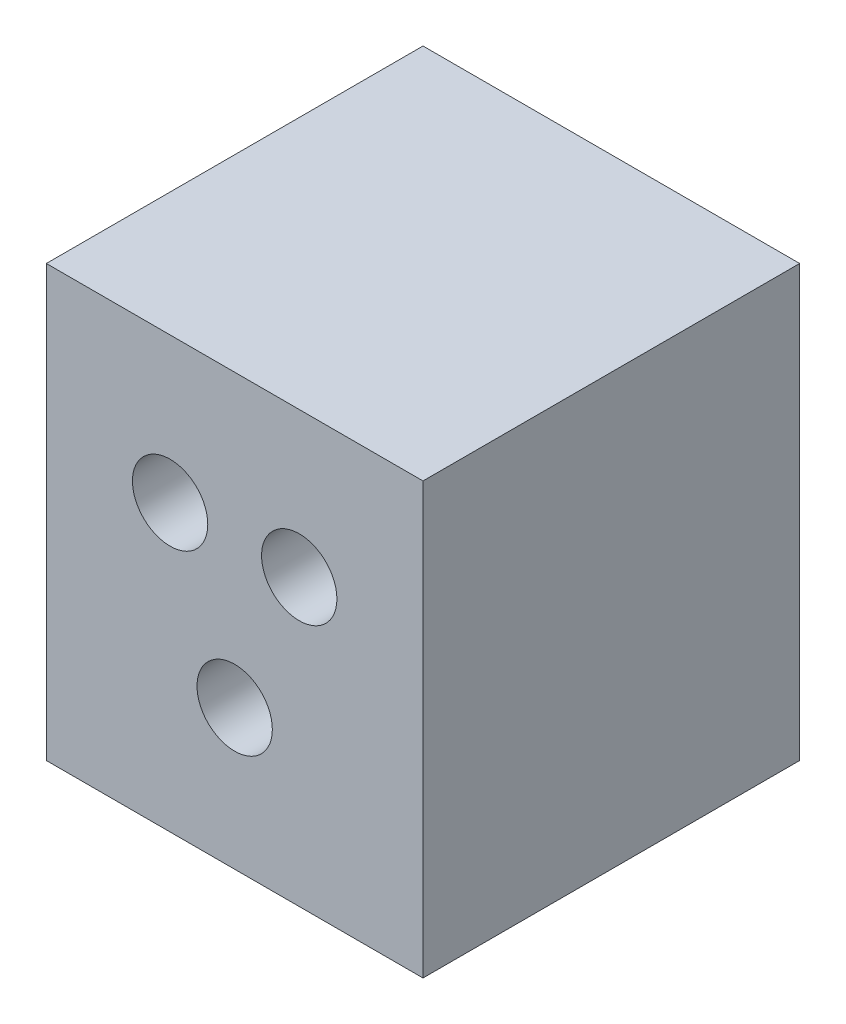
ISO-10303-21;
HEADER;
FILE_DESCRIPTION(('STEP AP214'),'2;1');
FILE_NAME('part.step','',(''),(''),'','','');
FILE_SCHEMA(('AUTOMOTIVE_DESIGN { 1 0 10303 214 1 1 1 1 }'));
ENDSEC;
DATA;
#1=APPLICATION_CONTEXT('core data for automotive mechanical design processes');
#2=APPLICATION_PROTOCOL_DEFINITION('international standard','automotive_design',2000,#1);
#3=PRODUCT_CONTEXT('',#1,'mechanical');
#4=PRODUCT('Part','Part','',(#3));
#5=PRODUCT_RELATED_PRODUCT_CATEGORY('part','',(#4));
#6=PRODUCT_DEFINITION_FORMATION('','',#4);
#7=PRODUCT_DEFINITION_CONTEXT('part definition',#1,'design');
#8=PRODUCT_DEFINITION('design','',#6,#7);
#9=PRODUCT_DEFINITION_SHAPE('','',#8);
#10=(LENGTH_UNIT() NAMED_UNIT(*) SI_UNIT(.MILLI.,.METRE.));
#11=(NAMED_UNIT(*) PLANE_ANGLE_UNIT() SI_UNIT($,.RADIAN.));
#12=(NAMED_UNIT(*) SI_UNIT($,.STERADIAN.) SOLID_ANGLE_UNIT());
#13=UNCERTAINTY_MEASURE_WITH_UNIT(LENGTH_MEASURE(1.E-05),#10,'distance_accuracy_value','');
#14=(GEOMETRIC_REPRESENTATION_CONTEXT(3) GLOBAL_UNCERTAINTY_ASSIGNED_CONTEXT((#13)) GLOBAL_UNIT_ASSIGNED_CONTEXT((#10,
#11,#12)) REPRESENTATION_CONTEXT('',''));
#15=CARTESIAN_POINT('',(0.,0.,0.));
#16=DIRECTION('',(0.,0.,1.));
#17=DIRECTION('',(1.,0.,0.));
#18=AXIS2_PLACEMENT_3D('',#15,#16,#17);
#19=CARTESIAN_POINT('',(0.,0.,35.));
#20=DIRECTION('',(1.,0.,0.));
#21=DIRECTION('',(0.,0.,-1.));
#22=AXIS2_PLACEMENT_3D('',#19,#20,#21);
#23=PLANE('',#22);
#24=DIRECTION('',(0.,-1.,0.));
#25=VECTOR('',#24,1.);
#26=CARTESIAN_POINT('',(0.,0.,0.));
#27=LINE('',#26,#25);
#28=CARTESIAN_POINT('',(0.,40.,0.));
#29=VERTEX_POINT('',#28);
#30=CARTESIAN_POINT('',(0.,0.,0.));
#31=VERTEX_POINT('',#30);
#32=EDGE_CURVE('E102',#29,#31,#27,.T.);
#33=ORIENTED_EDGE('',*,*,#32,.T.);
#34=DIRECTION('',(0.,0.,-1.));
#35=VECTOR('',#34,1.);
#36=CARTESIAN_POINT('',(0.,0.,35.));
#37=LINE('',#36,#35);
#38=CARTESIAN_POINT('',(0.,0.,35.));
#39=VERTEX_POINT('',#38);
#40=EDGE_CURVE('E11',#39,#31,#37,.T.);
#41=ORIENTED_EDGE('',*,*,#40,.F.);
#42=DIRECTION('',(0.,-1.,0.));
#43=VECTOR('',#42,1.);
#44=CARTESIAN_POINT('',(0.,0.,35.));
#45=LINE('',#44,#43);
#46=CARTESIAN_POINT('',(0.,40.,35.));
#47=VERTEX_POINT('',#46);
#48=EDGE_CURVE('E111',#47,#39,#45,.T.);
#49=ORIENTED_EDGE('',*,*,#48,.F.);
#50=DIRECTION('',(0.,0.,-1.));
#51=VECTOR('',#50,1.);
#52=CARTESIAN_POINT('',(0.,40.,35.));
#53=LINE('',#52,#51);
#54=EDGE_CURVE('E117',#47,#29,#53,.T.);
#55=ORIENTED_EDGE('',*,*,#54,.T.);
#56=EDGE_LOOP('',(#33,#41,#49,#55));
#57=FACE_BOUND('',#56,.T.);
#58=ADVANCED_FACE('F29',(#57),#23,.F.);
#59=CARTESIAN_POINT('',(0.,0.,35.));
#60=DIRECTION('',(0.,1.,0.));
#61=DIRECTION('',(0.,0.,1.));
#62=AXIS2_PLACEMENT_3D('',#59,#60,#61);
#63=PLANE('',#62);
#64=DIRECTION('',(1.,0.,0.));
#65=VECTOR('',#64,1.);
#66=CARTESIAN_POINT('',(0.,0.,0.));
#67=LINE('',#66,#65);
#68=CARTESIAN_POINT('',(35.,0.,0.));
#69=VERTEX_POINT('',#68);
#70=EDGE_CURVE('E105',#31,#69,#67,.T.);
#71=ORIENTED_EDGE('',*,*,#70,.T.);
#72=DIRECTION('',(0.,0.,-1.));
#73=VECTOR('',#72,1.);
#74=CARTESIAN_POINT('',(35.,0.,35.));
#75=LINE('',#74,#73);
#76=CARTESIAN_POINT('',(35.,0.,35.));
#77=VERTEX_POINT('',#76);
#78=EDGE_CURVE('E36',#77,#69,#75,.T.);
#79=ORIENTED_EDGE('',*,*,#78,.F.);
#80=DIRECTION('',(1.,0.,0.));
#81=VECTOR('',#80,1.);
#82=CARTESIAN_POINT('',(0.,0.,35.));
#83=LINE('',#82,#81);
#84=EDGE_CURVE('E113',#39,#77,#83,.T.);
#85=ORIENTED_EDGE('',*,*,#84,.F.);
#86=ORIENTED_EDGE('',*,*,#40,.T.);
#87=EDGE_LOOP('',(#71,#79,#85,#86));
#88=FACE_BOUND('',#87,.T.);
#89=ADVANCED_FACE('F138',(#88),#63,.F.);
#90=CARTESIAN_POINT('',(35.,0.,35.));
#91=DIRECTION('',(-1.,0.,0.));
#92=DIRECTION('',(0.,-1.,0.));
#93=AXIS2_PLACEMENT_3D('',#90,#91,#92);
#94=PLANE('',#93);
#95=DIRECTION('',(0.,1.,0.));
#96=VECTOR('',#95,1.);
#97=CARTESIAN_POINT('',(35.,0.,0.));
#98=LINE('',#97,#96);
#99=CARTESIAN_POINT('',(35.,40.,0.));
#100=VERTEX_POINT('',#99);
#101=EDGE_CURVE('E107',#69,#100,#98,.T.);
#102=ORIENTED_EDGE('',*,*,#101,.T.);
#103=DIRECTION('',(0.,0.,-1.));
#104=VECTOR('',#103,1.);
#105=CARTESIAN_POINT('',(35.,40.,35.));
#106=LINE('',#105,#104);
#107=CARTESIAN_POINT('',(35.,40.,35.));
#108=VERTEX_POINT('',#107);
#109=EDGE_CURVE('E120',#108,#100,#106,.T.);
#110=ORIENTED_EDGE('',*,*,#109,.F.);
#111=DIRECTION('',(0.,1.,0.));
#112=VECTOR('',#111,1.);
#113=CARTESIAN_POINT('',(35.,0.,35.));
#114=LINE('',#113,#112);
#115=EDGE_CURVE('E48',#77,#108,#114,.T.);
#116=ORIENTED_EDGE('',*,*,#115,.F.);
#117=ORIENTED_EDGE('',*,*,#78,.T.);
#118=EDGE_LOOP('',(#102,#110,#116,#117));
#119=FACE_BOUND('',#118,.T.);
#120=ADVANCED_FACE('F126',(#119),#94,.F.);
#121=CARTESIAN_POINT('',(0.,40.,35.));
#122=DIRECTION('',(0.,-1.,0.));
#123=DIRECTION('',(0.,0.,-1.));
#124=AXIS2_PLACEMENT_3D('',#121,#122,#123);
#125=PLANE('',#124);
#126=DIRECTION('',(-1.,0.,0.));
#127=VECTOR('',#126,1.);
#128=CARTESIAN_POINT('',(0.,40.,0.));
#129=LINE('',#128,#127);
#130=EDGE_CURVE('E109',#100,#29,#129,.T.);
#131=ORIENTED_EDGE('',*,*,#130,.T.);
#132=ORIENTED_EDGE('',*,*,#54,.F.);
#133=DIRECTION('',(-1.,0.,0.));
#134=VECTOR('',#133,1.);
#135=CARTESIAN_POINT('',(0.,40.,35.));
#136=LINE('',#135,#134);
#137=EDGE_CURVE('E43',#108,#47,#136,.T.);
#138=ORIENTED_EDGE('',*,*,#137,.F.);
#139=ORIENTED_EDGE('',*,*,#109,.T.);
#140=EDGE_LOOP('',(#131,#132,#138,#139));
#141=FACE_BOUND('',#140,.T.);
#142=ADVANCED_FACE('F133',(#141),#125,.F.);
#143=CARTESIAN_POINT('',(0.,40.,35.));
#144=DIRECTION('',(0.,0.,-1.));
#145=DIRECTION('',(-1.,0.,0.));
#146=AXIS2_PLACEMENT_3D('',#143,#144,#145);
#147=PLANE('',#146);
#148=CARTESIAN_POINT('',(11.5,26.5,35.));
#149=DIRECTION('',(0.,0.,1.));
#150=DIRECTION('',(1.,0.,0.));
#151=AXIS2_PLACEMENT_3D('',#148,#149,#150);
#152=CIRCLE('',#151,3.5);
#153=CARTESIAN_POINT('',(15.,26.5,35.));
#154=VERTEX_POINT('',#153);
#155=EDGE_CURVE('E85',#154,#154,#152,.T.);
#156=ORIENTED_EDGE('',*,*,#155,.F.);
#157=EDGE_LOOP('',(#156));
#158=FACE_BOUND('',#157,.T.);
#159=CARTESIAN_POINT('',(23.5,26.5,35.));
#160=DIRECTION('',(0.,0.,1.));
#161=DIRECTION('',(1.,0.,0.));
#162=AXIS2_PLACEMENT_3D('',#159,#160,#161);
#163=CIRCLE('',#162,3.5);
#164=CARTESIAN_POINT('',(27.,26.5,35.));
#165=VERTEX_POINT('',#164);
#166=EDGE_CURVE('E93',#165,#165,#163,.T.);
#167=ORIENTED_EDGE('',*,*,#166,.F.);
#168=EDGE_LOOP('',(#167));
#169=FACE_BOUND('',#168,.T.);
#170=CARTESIAN_POINT('',(17.5,13.,35.));
#171=DIRECTION('',(0.,0.,1.));
#172=DIRECTION('',(1.,0.,0.));
#173=AXIS2_PLACEMENT_3D('',#170,#171,#172);
#174=CIRCLE('',#173,3.5);
#175=CARTESIAN_POINT('',(21.,13.,35.));
#176=VERTEX_POINT('',#175);
#177=EDGE_CURVE('E99',#176,#176,#174,.T.);
#178=ORIENTED_EDGE('',*,*,#177,.F.);
#179=EDGE_LOOP('',(#178));
#180=FACE_BOUND('',#179,.T.);
#181=ORIENTED_EDGE('',*,*,#48,.T.);
#182=ORIENTED_EDGE('',*,*,#84,.T.);
#183=ORIENTED_EDGE('',*,*,#115,.T.);
#184=ORIENTED_EDGE('',*,*,#137,.T.);
#185=EDGE_LOOP('',(#181,#182,#183,#184));
#186=FACE_BOUND('',#185,.T.);
#187=ADVANCED_FACE('F137',(#158,#169,#180,#186),#147,.F.);
#188=CARTESIAN_POINT('',(0.,40.,0.));
#189=DIRECTION('',(0.,0.,-1.));
#190=DIRECTION('',(-1.,0.,0.));
#191=AXIS2_PLACEMENT_3D('',#188,#189,#190);
#192=PLANE('',#191);
#193=ORIENTED_EDGE('',*,*,#32,.F.);
#194=ORIENTED_EDGE('',*,*,#130,.F.);
#195=ORIENTED_EDGE('',*,*,#101,.F.);
#196=ORIENTED_EDGE('',*,*,#70,.F.);
#197=EDGE_LOOP('',(#193,#194,#195,#196));
#198=FACE_BOUND('',#197,.T.);
#199=ADVANCED_FACE('F131',(#198),#192,.T.);
#200=CARTESIAN_POINT('',(17.5,13.,35.));
#201=DIRECTION('',(0.,0.,1.));
#202=DIRECTION('',(1.,0.,0.));
#203=AXIS2_PLACEMENT_3D('',#200,#201,#202);
#204=CYLINDRICAL_SURFACE('',#203,3.5);
#205=CARTESIAN_POINT('',(17.5,13.,16.));
#206=DIRECTION('',(0.,0.,1.));
#207=DIRECTION('',(1.,0.,0.));
#208=AXIS2_PLACEMENT_3D('',#205,#206,#207);
#209=CIRCLE('',#208,3.5);
#210=CARTESIAN_POINT('',(21.,13.,16.));
#211=VERTEX_POINT('',#210);
#212=EDGE_CURVE('E96',#211,#211,#209,.T.);
#213=ORIENTED_EDGE('',*,*,#212,.F.);
#214=EDGE_LOOP('',(#213));
#215=FACE_BOUND('',#214,.T.);
#216=ORIENTED_EDGE('',*,*,#177,.T.);
#217=EDGE_LOOP('',(#216));
#218=FACE_BOUND('',#217,.T.);
#219=ADVANCED_FACE('F153',(#215,#218),#204,.F.);
#220=CARTESIAN_POINT('',(17.5,13.,16.));
#221=DIRECTION('',(0.,0.,1.));
#222=DIRECTION('',(1.,0.,0.));
#223=AXIS2_PLACEMENT_3D('',#220,#221,#222);
#224=CONICAL_SURFACE('',#223,3.5,1.02974425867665);
#225=CARTESIAN_POINT('',(17.5,13.,13.8969878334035));
#226=VERTEX_POINT('',#225);
#227=VERTEX_LOOP('',#226);
#228=FACE_BOUND('',#227,.T.);
#229=ORIENTED_EDGE('',*,*,#212,.T.);
#230=EDGE_LOOP('',(#229));
#231=FACE_BOUND('',#230,.T.);
#232=ADVANCED_FACE('F156',(#228,#231),#224,.F.);
#233=CARTESIAN_POINT('',(23.5,26.5,35.));
#234=DIRECTION('',(0.,0.,1.));
#235=DIRECTION('',(1.,0.,0.));
#236=AXIS2_PLACEMENT_3D('',#233,#234,#235);
#237=CYLINDRICAL_SURFACE('',#236,3.5);
#238=CARTESIAN_POINT('',(23.5,26.5,16.));
#239=DIRECTION('',(0.,0.,1.));
#240=DIRECTION('',(1.,0.,0.));
#241=AXIS2_PLACEMENT_3D('',#238,#239,#240);
#242=CIRCLE('',#241,3.5);
#243=CARTESIAN_POINT('',(27.,26.5,16.));
#244=VERTEX_POINT('',#243);
#245=EDGE_CURVE('E88',#244,#244,#242,.T.);
#246=ORIENTED_EDGE('',*,*,#245,.F.);
#247=EDGE_LOOP('',(#246));
#248=FACE_BOUND('',#247,.T.);
#249=ORIENTED_EDGE('',*,*,#166,.T.);
#250=EDGE_LOOP('',(#249));
#251=FACE_BOUND('',#250,.T.);
#252=ADVANCED_FACE('F160',(#248,#251),#237,.F.);
#253=CARTESIAN_POINT('',(23.5,26.5,16.));
#254=DIRECTION('',(0.,0.,1.));
#255=DIRECTION('',(1.,0.,0.));
#256=AXIS2_PLACEMENT_3D('',#253,#254,#255);
#257=CONICAL_SURFACE('',#256,3.5,1.02974425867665);
#258=CARTESIAN_POINT('',(23.5,26.5,13.8969878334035));
#259=VERTEX_POINT('',#258);
#260=VERTEX_LOOP('',#259);
#261=FACE_BOUND('',#260,.T.);
#262=ORIENTED_EDGE('',*,*,#245,.T.);
#263=EDGE_LOOP('',(#262));
#264=FACE_BOUND('',#263,.T.);
#265=ADVANCED_FACE('F164',(#261,#264),#257,.F.);
#266=CARTESIAN_POINT('',(11.5,26.5,35.));
#267=DIRECTION('',(0.,0.,1.));
#268=DIRECTION('',(1.,0.,0.));
#269=AXIS2_PLACEMENT_3D('',#266,#267,#268);
#270=CYLINDRICAL_SURFACE('',#269,3.5);
#271=CARTESIAN_POINT('',(11.5,26.5,16.));
#272=DIRECTION('',(0.,0.,1.));
#273=DIRECTION('',(1.,0.,0.));
#274=AXIS2_PLACEMENT_3D('',#271,#272,#273);
#275=CIRCLE('',#274,3.49999999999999);
#276=CARTESIAN_POINT('',(15.,26.5,16.));
#277=VERTEX_POINT('',#276);
#278=EDGE_CURVE('E83',#277,#277,#275,.T.);
#279=ORIENTED_EDGE('',*,*,#278,.F.);
#280=EDGE_LOOP('',(#279));
#281=FACE_BOUND('',#280,.T.);
#282=ORIENTED_EDGE('',*,*,#155,.T.);
#283=EDGE_LOOP('',(#282));
#284=FACE_BOUND('',#283,.T.);
#285=ADVANCED_FACE('F79',(#281,#284),#270,.F.);
#286=CARTESIAN_POINT('',(11.5,26.5,16.));
#287=DIRECTION('',(0.,0.,1.));
#288=DIRECTION('',(1.,0.,0.));
#289=AXIS2_PLACEMENT_3D('',#286,#287,#288);
#290=CONICAL_SURFACE('',#289,3.49999999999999,1.02974425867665);
#291=CARTESIAN_POINT('',(11.5,26.5,13.8969878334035));
#292=VERTEX_POINT('',#291);
#293=VERTEX_LOOP('',#292);
#294=FACE_BOUND('',#293,.T.);
#295=ORIENTED_EDGE('',*,*,#278,.T.);
#296=EDGE_LOOP('',(#295));
#297=FACE_BOUND('',#296,.T.);
#298=ADVANCED_FACE('F76',(#294,#297),#290,.F.);
#299=CLOSED_SHELL('',(#58,#89,#120,#142,#187,#199,#219,#232,#252,#265,#285,#298));
#300=MANIFOLD_SOLID_BREP('B2',#299);
#301=ADVANCED_BREP_SHAPE_REPRESENTATION('',(#18,#300),#14);
#302=SHAPE_DEFINITION_REPRESENTATION(#9,#301);
ENDSEC;
END-ISO-10303-21;
